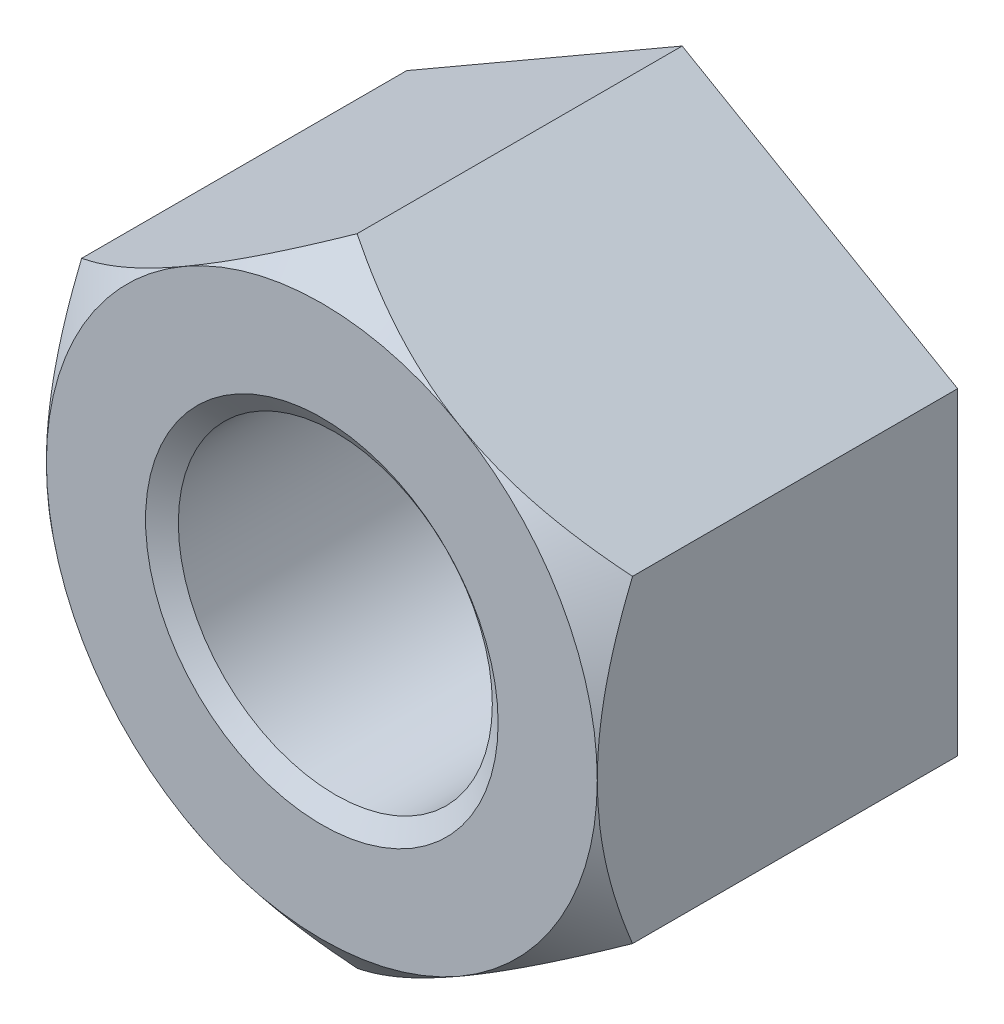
ISO-10303-21;
HEADER;
FILE_DESCRIPTION(('STEP AP214'),'2;1');
FILE_NAME('part.step','',(''),(''),'','','');
FILE_SCHEMA(('AUTOMOTIVE_DESIGN { 1 0 10303 214 1 1 1 1 }'));
ENDSEC;
DATA;
#1=APPLICATION_CONTEXT('core data for automotive mechanical design processes');
#2=APPLICATION_PROTOCOL_DEFINITION('international standard','automotive_design',2000,#1);
#3=PRODUCT_CONTEXT('',#1,'mechanical');
#4=PRODUCT('Part','Part','',(#3));
#5=PRODUCT_RELATED_PRODUCT_CATEGORY('part','',(#4));
#6=PRODUCT_DEFINITION_FORMATION('','',#4);
#7=PRODUCT_DEFINITION_CONTEXT('part definition',#1,'design');
#8=PRODUCT_DEFINITION('design','',#6,#7);
#9=PRODUCT_DEFINITION_SHAPE('','',#8);
#10=(LENGTH_UNIT() NAMED_UNIT(*) SI_UNIT(.MILLI.,.METRE.));
#11=(NAMED_UNIT(*) PLANE_ANGLE_UNIT() SI_UNIT($,.RADIAN.));
#12=(NAMED_UNIT(*) SI_UNIT($,.STERADIAN.) SOLID_ANGLE_UNIT());
#13=UNCERTAINTY_MEASURE_WITH_UNIT(LENGTH_MEASURE(1.E-05),#10,'distance_accuracy_value','');
#14=(GEOMETRIC_REPRESENTATION_CONTEXT(3) GLOBAL_UNCERTAINTY_ASSIGNED_CONTEXT((#13)) GLOBAL_UNIT_ASSIGNED_CONTEXT((#10,
#11,#12)) REPRESENTATION_CONTEXT('',''));
#15=CARTESIAN_POINT('',(0.,0.,0.));
#16=DIRECTION('',(0.,0.,1.));
#17=DIRECTION('',(1.,0.,0.));
#18=AXIS2_PLACEMENT_3D('',#15,#16,#17);
#19=CARTESIAN_POINT('',(0.,0.,-51.9176));
#20=DIRECTION('',(0.,0.,1.));
#21=DIRECTION('',(1.,0.,0.));
#22=AXIS2_PLACEMENT_3D('',#19,#20,#21);
#23=CYLINDRICAL_SURFACE('',#22,22.62124);
#24=CARTESIAN_POINT('',(0.,0.,-1.9457086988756));
#25=DIRECTION('',(0.,0.,1.));
#26=DIRECTION('',(1.,0.,0.));
#27=AXIS2_PLACEMENT_3D('',#24,#25,#26);
#28=CIRCLE('',#27,22.62124);
#29=CARTESIAN_POINT('',(22.62124,0.,-1.9457086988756));
#30=VERTEX_POINT('',#29);
#31=EDGE_CURVE('E137',#30,#30,#28,.F.);
#32=ORIENTED_EDGE('',*,*,#31,.F.);
#33=EDGE_LOOP('',(#32));
#34=FACE_BOUND('',#33,.T.);
#35=CARTESIAN_POINT('',(0.,0.,-49.9464913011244));
#36=DIRECTION('',(0.,0.,-1.));
#37=DIRECTION('',(-1.,0.,0.));
#38=AXIS2_PLACEMENT_3D('',#35,#36,#37);
#39=CIRCLE('',#38,22.62124);
#40=CARTESIAN_POINT('',(-22.62124,0.,-49.9464913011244));
#41=VERTEX_POINT('',#40);
#42=EDGE_CURVE('E44',#41,#41,#39,.F.);
#43=ORIENTED_EDGE('',*,*,#42,.F.);
#44=EDGE_LOOP('',(#43));
#45=FACE_BOUND('',#44,.T.);
#46=ADVANCED_FACE('F39',(#34,#45),#23,.F.);
#47=CARTESIAN_POINT('',(-79.3749999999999,0.,0.));
#48=DIRECTION('',(0.,0.,1.));
#49=DIRECTION('',(1.,0.,0.));
#50=AXIS2_PLACEMENT_3D('',#47,#48,#49);
#51=PLANE('',#50);
#52=CARTESIAN_POINT('',(0.,0.,0.));
#53=DIRECTION('',(0.,0.,1.));
#54=DIRECTION('',(1.,0.,0.));
#55=AXIS2_PLACEMENT_3D('',#52,#53,#54);
#56=CIRCLE('',#55,25.4);
#57=CARTESIAN_POINT('',(25.4,0.,0.));
#58=VERTEX_POINT('',#57);
#59=EDGE_CURVE('E232',#58,#58,#56,.T.);
#60=ORIENTED_EDGE('',*,*,#59,.F.);
#61=EDGE_LOOP('',(#60));
#62=FACE_BOUND('',#61,.T.);
#63=CARTESIAN_POINT('',(0.,0.,0.));
#64=DIRECTION('',(0.,0.,1.));
#65=DIRECTION('',(1.,0.,0.));
#66=AXIS2_PLACEMENT_3D('',#63,#64,#65);
#67=CIRCLE('',#66,39.6875);
#68=CARTESIAN_POINT('',(39.6875,0.,0.));
#69=VERTEX_POINT('',#68);
#70=CARTESIAN_POINT('',(19.84375,-34.3703832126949,0.));
#71=VERTEX_POINT('',#70);
#72=EDGE_CURVE('E11',#69,#71,#67,.F.);
#73=ORIENTED_EDGE('',*,*,#72,.F.);
#74=CARTESIAN_POINT('',(0.,0.,0.));
#75=DIRECTION('',(0.,0.,1.));
#76=DIRECTION('',(1.,0.,0.));
#77=AXIS2_PLACEMENT_3D('',#74,#75,#76);
#78=CIRCLE('',#77,39.6875);
#79=CARTESIAN_POINT('',(19.8437500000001,34.3703832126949,0.));
#80=VERTEX_POINT('',#79);
#81=EDGE_CURVE('E129',#69,#80,#78,.T.);
#82=ORIENTED_EDGE('',*,*,#81,.T.);
#83=CARTESIAN_POINT('',(-19.84375,34.3703832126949,0.));
#84=VERTEX_POINT('',#83);
#85=EDGE_CURVE('E51',#84,#80,#67,.F.);
#86=ORIENTED_EDGE('',*,*,#85,.F.);
#87=CARTESIAN_POINT('',(-39.6875,0.,0.));
#88=VERTEX_POINT('',#87);
#89=EDGE_CURVE('E286',#88,#84,#67,.F.);
#90=ORIENTED_EDGE('',*,*,#89,.F.);
#91=CARTESIAN_POINT('',(-19.84375,-34.3703832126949,0.));
#92=VERTEX_POINT('',#91);
#93=EDGE_CURVE('E288',#92,#88,#67,.F.);
#94=ORIENTED_EDGE('',*,*,#93,.F.);
#95=EDGE_CURVE('E49',#71,#92,#67,.F.);
#96=ORIENTED_EDGE('',*,*,#95,.F.);
#97=EDGE_LOOP('',(#73,#82,#86,#90,#94,#96));
#98=FACE_BOUND('',#97,.T.);
#99=ADVANCED_FACE('F139',(#62,#98),#51,.T.);
#100=CARTESIAN_POINT('',(0.,45.8271776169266,-51.9176));
#101=DIRECTION('',(-0.500000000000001,0.866025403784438,0.));
#102=DIRECTION('',(-0.866025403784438,-0.500000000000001,0.));
#103=AXIS2_PLACEMENT_3D('',#100,#101,#102);
#104=PLANE('',#103);
#105=CARTESIAN_POINT('',(0.000200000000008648,45.8272930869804,-5.08009554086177));
#106=CARTESIAN_POINT('',(-0.675362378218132,45.4372569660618,-4.75740980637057));
#107=CARTESIAN_POINT('',(-1.3547569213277,45.0450083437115,-4.44518483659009));
#108=CARTESIAN_POINT('',(-2.72161040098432,44.255855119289,-3.8444644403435));
#109=CARTESIAN_POINT('',(-3.40907190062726,43.8589490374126,-3.55597680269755));
#110=CARTESIAN_POINT('',(-4.79420473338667,43.0592422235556,-3.00488379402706));
#111=CARTESIAN_POINT('',(-5.49190147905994,42.6564268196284,-2.74236315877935));
#112=CARTESIAN_POINT('',(-6.89523688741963,41.8462107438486,-2.24748448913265));
#113=CARTESIAN_POINT('',(-7.60087484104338,41.4388104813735,-2.0151237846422));
#114=CARTESIAN_POINT('',(-9.01334120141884,40.6233226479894,-1.58581833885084));
#115=CARTESIAN_POINT('',(-9.72010005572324,40.2152752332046,-1.38856992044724));
#116=CARTESIAN_POINT('',(-11.1404844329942,39.3952159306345,-1.03010323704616));
#117=CARTESIAN_POINT('',(-11.8541100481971,38.9832039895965,-0.868885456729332));
#118=CARTESIAN_POINT('',(-13.2863448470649,38.1563028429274,-0.585602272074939));
#119=CARTESIAN_POINT('',(-14.0049472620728,37.7414175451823,-0.463491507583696));
#120=CARTESIAN_POINT('',(-15.446538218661,36.9091146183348,-0.260639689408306));
#121=CARTESIAN_POINT('',(-16.1695267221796,36.4916970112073,-0.179898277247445));
#122=CARTESIAN_POINT('',(-17.630331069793,35.6483012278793,-0.0605545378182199));
#123=CARTESIAN_POINT('',(-18.368192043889,35.2222969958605,-0.0226825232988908));
#124=CARTESIAN_POINT('',(-19.8446204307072,34.3698806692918,0.00757152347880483));
#125=CARTESIAN_POINT('',(-20.5831878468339,33.9434685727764,-4.66645945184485E-05));
#126=CARTESIAN_POINT('',(-22.059242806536,33.0912678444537,-0.0606042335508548));
#127=CARTESIAN_POINT('',(-22.7967297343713,32.6654795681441,-0.113563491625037));
#128=CARTESIAN_POINT('',(-24.2683079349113,31.8158634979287,-0.263592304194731));
#129=CARTESIAN_POINT('',(-25.0023992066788,31.3920357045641,-0.360661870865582));
#130=CARTESIAN_POINT('',(-26.465573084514,30.5472718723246,-0.596784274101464));
#131=CARTESIAN_POINT('',(-27.194654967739,30.1263362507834,-0.735843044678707));
#132=CARTESIAN_POINT('',(-28.6463836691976,29.288180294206,-1.05312836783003));
#133=CARTESIAN_POINT('',(-29.3690302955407,28.8709600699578,-1.23135608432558));
#134=CARTESIAN_POINT('',(-30.8067522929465,28.0408908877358,-1.62370548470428));
#135=CARTESIAN_POINT('',(-31.5218294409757,27.6280409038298,-1.83781853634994));
#136=CARTESIAN_POINT('',(-32.944072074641,26.8069087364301,-2.2985964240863));
#137=CARTESIAN_POINT('',(-33.6512373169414,26.3986266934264,-2.54526225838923));
#138=CARTESIAN_POINT('',(-34.8062681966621,25.7317693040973,-2.97446619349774));
#139=CARTESIAN_POINT('',(-35.2565422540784,25.471803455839,-3.14844506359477));
#140=CARTESIAN_POINT('',(-36.1535852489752,24.9538954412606,-3.50755980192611));
#141=CARTESIAN_POINT('',(-36.6003552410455,24.695952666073,-3.69269215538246));
#142=CARTESIAN_POINT('',(-37.4890449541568,24.1828674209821,-4.07269340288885));
#143=CARTESIAN_POINT('',(-37.9309759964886,23.9277184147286,-4.26752708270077));
#144=CARTESIAN_POINT('',(-38.811702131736,23.4192309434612,-4.66680287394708));
#145=CARTESIAN_POINT('',(-39.2504964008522,23.1658929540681,-4.87124740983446));
#146=CARTESIAN_POINT('',(-39.6877,22.9134733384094,-5.08009554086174));
#147=B_SPLINE_CURVE_WITH_KNOTS('',3,(#105,#106,#107,#108,#109,#110,#111,#112,#113,#114,#115,
#116,#117,#118,#119,#120,#121,#122,#123,#124,#125,#126,#127,#128,#129,#130,#131,#132,#133,#134,
#135,#136,#137,#138,#139,#140,#141,#142,#143,#144,#145,#146),.UNSPECIFIED.,.F.,.F.,(4,2,2,2,2,2,
2,2,2,2,2,2,2,2,2,2,2,2,2,2,4),(0.,2.53259620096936,5.06602012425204,7.60745580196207,
10.1486663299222,12.6667002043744,15.1847679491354,17.6999043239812,20.2150189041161,
22.7723642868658,25.329722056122,27.888201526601,30.4466817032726,33.0055236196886,
35.5644415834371,38.1227448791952,40.6811266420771,42.3258117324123,43.9699812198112,
45.608565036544,47.2475644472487),.UNSPECIFIED.);
#148=CARTESIAN_POINT('',(0.,45.8271776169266,-5.08));
#149=VERTEX_POINT('',#148);
#150=EDGE_CURVE('E193',#149,#84,#147,.T.);
#151=ORIENTED_EDGE('',*,*,#150,.F.);
#152=DIRECTION('',(0.,0.,1.));
#153=VECTOR('',#152,1.);
#154=CARTESIAN_POINT('',(0.,45.8271776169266,-51.9176));
#155=LINE('',#154,#153);
#156=CARTESIAN_POINT('',(0.,45.8271776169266,-51.9176));
#157=VERTEX_POINT('',#156);
#158=EDGE_CURVE('E256',#157,#149,#155,.T.);
#159=ORIENTED_EDGE('',*,*,#158,.F.);
#160=DIRECTION('',(-0.866025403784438,-0.500000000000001,0.));
#161=VECTOR('',#160,1.);
#162=CARTESIAN_POINT('',(0.,45.8271776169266,-51.9176));
#163=LINE('',#162,#161);
#164=CARTESIAN_POINT('',(-39.6875,22.9135888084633,-51.9176));
#165=VERTEX_POINT('',#164);
#166=EDGE_CURVE('E145',#157,#165,#163,.T.);
#167=ORIENTED_EDGE('',*,*,#166,.T.);
#168=DIRECTION('',(0.,0.,1.));
#169=VECTOR('',#168,1.);
#170=CARTESIAN_POINT('',(-39.6875,22.9135888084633,-51.9176));
#171=LINE('',#170,#169);
#172=CARTESIAN_POINT('',(-39.6875,22.9135888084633,-5.08));
#173=VERTEX_POINT('',#172);
#174=EDGE_CURVE('E243',#165,#173,#171,.T.);
#175=ORIENTED_EDGE('',*,*,#174,.T.);
#176=EDGE_CURVE('E187',#84,#173,#147,.T.);
#177=ORIENTED_EDGE('',*,*,#176,.F.);
#178=EDGE_LOOP('',(#151,#159,#167,#175,#177));
#179=FACE_BOUND('',#178,.T.);
#180=ADVANCED_FACE('F41',(#179),#104,.T.);
#181=CARTESIAN_POINT('',(39.6875,22.9135888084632,-51.9176));
#182=DIRECTION('',(0.500000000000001,0.866025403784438,0.));
#183=DIRECTION('',(-0.866025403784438,0.500000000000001,0.));
#184=AXIS2_PLACEMENT_3D('',#181,#182,#183);
#185=PLANE('',#184);
#186=CARTESIAN_POINT('',(39.6877,22.9134733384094,-5.08009554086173));
#187=CARTESIAN_POINT('',(39.0121376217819,23.303509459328,-4.75740980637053));
#188=CARTESIAN_POINT('',(38.3327430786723,23.6957580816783,-4.44518483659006));
#189=CARTESIAN_POINT('',(36.9658895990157,24.4849113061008,-3.84446444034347));
#190=CARTESIAN_POINT('',(36.2784280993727,24.8818173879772,-3.55597680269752));
#191=CARTESIAN_POINT('',(34.8932952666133,25.6815242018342,-3.00488379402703));
#192=CARTESIAN_POINT('',(34.1955985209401,26.0843396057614,-2.74236315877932));
#193=CARTESIAN_POINT('',(32.7922631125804,26.8945556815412,-2.24748448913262));
#194=CARTESIAN_POINT('',(32.0866251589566,27.3019559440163,-2.01512378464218));
#195=CARTESIAN_POINT('',(30.6741587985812,28.1174437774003,-1.58581833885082));
#196=CARTESIAN_POINT('',(29.9673999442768,28.5254911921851,-1.38856992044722));
#197=CARTESIAN_POINT('',(28.5470155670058,29.3455504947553,-1.03010323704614));
#198=CARTESIAN_POINT('',(27.8333899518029,29.7575624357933,-0.868885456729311));
#199=CARTESIAN_POINT('',(26.4011551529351,30.5844635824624,-0.585602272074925));
#200=CARTESIAN_POINT('',(25.6825527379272,30.9993488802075,-0.463491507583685));
#201=CARTESIAN_POINT('',(24.240961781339,31.831651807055,-0.260639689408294));
#202=CARTESIAN_POINT('',(23.5179732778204,32.2490694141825,-0.179898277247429));
#203=CARTESIAN_POINT('',(22.057168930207,33.0924651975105,-0.060554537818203));
#204=CARTESIAN_POINT('',(21.3193079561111,33.5184694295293,-0.0226825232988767));
#205=CARTESIAN_POINT('',(19.8428795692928,34.370885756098,0.0075715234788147));
#206=CARTESIAN_POINT('',(19.1043121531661,34.7972978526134,-4.66645945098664E-05));
#207=CARTESIAN_POINT('',(17.628257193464,35.6494985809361,-0.0606042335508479));
#208=CARTESIAN_POINT('',(16.8907702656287,36.0752868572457,-0.11356349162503));
#209=CARTESIAN_POINT('',(15.4191920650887,36.924902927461,-0.263592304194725));
#210=CARTESIAN_POINT('',(14.6851007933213,37.3487307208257,-0.360661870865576));
#211=CARTESIAN_POINT('',(13.221926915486,38.1934945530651,-0.596784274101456));
#212=CARTESIAN_POINT('',(12.492845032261,38.6144301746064,-0.7358430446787));
#213=CARTESIAN_POINT('',(11.0411163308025,39.4525861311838,-1.05312836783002));
#214=CARTESIAN_POINT('',(10.3184697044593,39.869806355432,-1.23135608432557));
#215=CARTESIAN_POINT('',(8.88074770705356,40.699875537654,-1.62370548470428));
#216=CARTESIAN_POINT('',(8.16567055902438,41.11272552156,-1.83781853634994));
#217=CARTESIAN_POINT('',(6.74342792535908,41.9338576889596,-2.29859642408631));
#218=CARTESIAN_POINT('',(6.0362626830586,42.3421397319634,-2.54526225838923));
#219=CARTESIAN_POINT('',(4.8812318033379,43.0089971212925,-2.97446619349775));
#220=CARTESIAN_POINT('',(4.43095774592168,43.2689629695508,-3.14844506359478));
#221=CARTESIAN_POINT('',(3.53391475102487,43.7868709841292,-3.50755980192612));
#222=CARTESIAN_POINT('',(3.08714475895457,44.0448137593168,-3.69269215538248));
#223=CARTESIAN_POINT('',(2.19845504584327,44.5578990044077,-4.07269340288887));
#224=CARTESIAN_POINT('',(1.75652400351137,44.8130480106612,-4.26752708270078));
#225=CARTESIAN_POINT('',(0.875797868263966,45.3215354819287,-4.6668028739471));
#226=CARTESIAN_POINT('',(0.437003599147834,45.5748734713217,-4.87124740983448));
#227=CARTESIAN_POINT('',(-0.000199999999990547,45.8272930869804,-5.08009554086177));
#228=B_SPLINE_CURVE_WITH_KNOTS('',3,(#186,#187,#188,#189,#190,#191,#192,#193,#194,#195,#196,
#197,#198,#199,#200,#201,#202,#203,#204,#205,#206,#207,#208,#209,#210,#211,#212,#213,#214,#215,
#216,#217,#218,#219,#220,#221,#222,#223,#224,#225,#226,#227),.UNSPECIFIED.,.F.,.F.,(4,2,2,2,2,2,
2,2,2,2,2,2,2,2,2,2,2,2,2,2,4),(0.,2.53259620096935,5.06602012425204,7.60745580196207,
10.1486663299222,12.6667002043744,15.1847679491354,17.6999043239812,20.2150189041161,
22.7723642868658,25.329722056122,27.888201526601,30.4466817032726,33.0055236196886,
35.564441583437,38.1227448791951,40.681126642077,42.3258117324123,43.9699812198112,
45.608565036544,47.2475644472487),.UNSPECIFIED.);
#229=CARTESIAN_POINT('',(39.6875,22.9135888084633,-5.08));
#230=VERTEX_POINT('',#229);
#231=EDGE_CURVE('E132',#230,#80,#228,.T.);
#232=ORIENTED_EDGE('',*,*,#231,.F.);
#233=DIRECTION('',(0.,0.,1.));
#234=VECTOR('',#233,1.);
#235=CARTESIAN_POINT('',(39.6875,22.9135888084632,-51.9176));
#236=LINE('',#235,#234);
#237=CARTESIAN_POINT('',(39.6875,22.9135888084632,-51.9176));
#238=VERTEX_POINT('',#237);
#239=EDGE_CURVE('E144',#238,#230,#236,.T.);
#240=ORIENTED_EDGE('',*,*,#239,.F.);
#241=DIRECTION('',(-0.866025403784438,0.500000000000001,0.));
#242=VECTOR('',#241,1.);
#243=CARTESIAN_POINT('',(39.6875,22.9135888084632,-51.9176));
#244=LINE('',#243,#242);
#245=EDGE_CURVE('E247',#238,#157,#244,.T.);
#246=ORIENTED_EDGE('',*,*,#245,.T.);
#247=ORIENTED_EDGE('',*,*,#158,.T.);
#248=EDGE_CURVE('E156',#80,#149,#228,.T.);
#249=ORIENTED_EDGE('',*,*,#248,.F.);
#250=EDGE_LOOP('',(#232,#240,#246,#247,#249));
#251=FACE_BOUND('',#250,.T.);
#252=ADVANCED_FACE('F172',(#251),#185,.T.);
#253=CARTESIAN_POINT('',(39.6875,22.9135888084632,-51.9176));
#254=DIRECTION('',(-1.,0.,0.));
#255=DIRECTION('',(0.,-1.,0.));
#256=AXIS2_PLACEMENT_3D('',#253,#254,#255);
#257=PLANE('',#256);
#258=ORIENTED_EDGE('',*,*,#239,.T.);
#259=CARTESIAN_POINT('',(39.6875,-51.6328225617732,-21.0457198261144));
#260=CARTESIAN_POINT('',(39.6875,-50.9711763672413,-20.6116874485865));
#261=CARTESIAN_POINT('',(39.6875,-50.3081162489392,-20.1798041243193));
#262=CARTESIAN_POINT('',(39.6875,-48.9789178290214,-19.3207795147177));
#263=CARTESIAN_POINT('',(39.6875,-48.3127794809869,-18.8936383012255));
#264=CARTESIAN_POINT('',(39.6875,-46.9770520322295,-18.0444645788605));
#265=CARTESIAN_POINT('',(39.6875,-46.3074622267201,-17.6224331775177));
#266=CARTESIAN_POINT('',(39.6875,-44.9647085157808,-16.7841033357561));
#267=CARTESIAN_POINT('',(39.6875,-44.2915446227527,-16.3678048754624));
#268=CARTESIAN_POINT('',(39.6875,-42.2568910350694,-15.1226295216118));
#269=CARTESIAN_POINT('',(39.6875,-40.8894876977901,-14.303373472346));
#270=CARTESIAN_POINT('',(39.6875,-38.1364157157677,-12.6961963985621));
#271=CARTESIAN_POINT('',(39.6875,-36.7507482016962,-11.9082734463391));
#272=CARTESIAN_POINT('',(39.6875,-34.6202465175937,-10.7357414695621));
#273=CARTESIAN_POINT('',(39.6875,-33.883142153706,-10.3370700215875));
#274=CARTESIAN_POINT('',(39.6875,-32.4025093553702,-9.5518101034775));
#275=CARTESIAN_POINT('',(39.6875,-31.6589809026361,-9.1652216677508));
#276=CARTESIAN_POINT('',(39.6875,-30.1648802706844,-8.40558030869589));
#277=CARTESIAN_POINT('',(39.6875,-29.4143069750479,-8.03252957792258));
#278=CARTESIAN_POINT('',(39.6875,-27.9057210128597,-7.30176643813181));
#279=CARTESIAN_POINT('',(39.6875,-27.1477083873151,-6.94405394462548));
#280=CARTESIAN_POINT('',(39.6875,-25.6257322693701,-6.24685408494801));
#281=CARTESIAN_POINT('',(39.6875,-24.8617895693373,-5.9073214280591));
#282=CARTESIAN_POINT('',(39.6875,-23.3255198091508,-5.24768587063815));
#283=CARTESIAN_POINT('',(39.6875,-22.5531925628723,-4.92758340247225));
#284=CARTESIAN_POINT('',(39.6875,-21.0000557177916,-4.30940863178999));
#285=CARTESIAN_POINT('',(39.6875,-20.2192491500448,-4.01132873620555));
#286=CARTESIAN_POINT('',(39.6875,-18.6486688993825,-3.43983380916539));
#287=CARTESIAN_POINT('',(39.6875,-17.8588956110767,-3.16641769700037));
#288=CARTESIAN_POINT('',(39.6875,-16.2782209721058,-2.64980510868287));
#289=CARTESIAN_POINT('',(39.6875,-15.4874096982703,-2.40633404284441));
#290=CARTESIAN_POINT('',(39.6875,-13.8971196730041,-1.949521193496));
#291=CARTESIAN_POINT('',(39.6875,-13.0976411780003,-1.73617852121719));
#292=CARTESIAN_POINT('',(39.6875,-11.490505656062,-1.34270689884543));
#293=CARTESIAN_POINT('',(39.6875,-10.6828485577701,-1.16257823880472));
#294=CARTESIAN_POINT('',(39.6875,-9.06026613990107,-0.838523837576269));
#295=CARTESIAN_POINT('',(39.6875,-8.24534084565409,-0.694597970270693));
#296=CARTESIAN_POINT('',(39.6875,-6.62443803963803,-0.44789053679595));
#297=CARTESIAN_POINT('',(39.6875,-5.81856783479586,-0.344407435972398));
#298=CARTESIAN_POINT('',(39.6875,-4.20271348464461,-0.176943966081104));
#299=CARTESIAN_POINT('',(39.6875,-3.39272937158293,-0.112963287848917));
#300=CARTESIAN_POINT('',(39.6875,-1.77060014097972,-0.0258418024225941));
#301=CARTESIAN_POINT('',(39.6875,-0.958455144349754,-0.00269875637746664));
#302=CARTESIAN_POINT('',(39.6875,0.665955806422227,0.00225284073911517));
#303=CARTESIAN_POINT('',(39.6875,1.47822175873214,-0.0159380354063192));
#304=CARTESIAN_POINT('',(39.6875,3.04262978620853,-0.0904816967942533));
#305=CARTESIAN_POINT('',(39.6875,3.79490888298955,-0.144006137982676));
#306=CARTESIAN_POINT('',(39.6875,5.29621422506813,-0.285354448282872));
#307=CARTESIAN_POINT('',(39.6875,6.04524051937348,-0.373177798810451));
#308=CARTESIAN_POINT('',(39.6875,7.53870946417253,-0.581619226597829));
#309=CARTESIAN_POINT('',(39.6875,8.28315200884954,-0.70223805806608));
#310=CARTESIAN_POINT('',(39.6875,9.76635407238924,-0.974351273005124));
#311=CARTESIAN_POINT('',(39.6875,10.5051135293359,-1.125845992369));
#312=CARTESIAN_POINT('',(39.6875,11.9915712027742,-1.4610042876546));
#313=CARTESIAN_POINT('',(39.6875,12.739131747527,-1.64527612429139));
#314=CARTESIAN_POINT('',(39.6875,14.22692970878,-2.04125829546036));
#315=CARTESIAN_POINT('',(39.6875,14.9671670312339,-2.25296898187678));
#316=CARTESIAN_POINT('',(39.6875,16.4398374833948,-2.70128400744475));
#317=CARTESIAN_POINT('',(39.6875,17.1722725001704,-2.93788216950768));
#318=CARTESIAN_POINT('',(39.6875,18.6294175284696,-3.43359252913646));
#319=CARTESIAN_POINT('',(39.6875,19.3541279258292,-3.6927035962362));
#320=CARTESIAN_POINT('',(39.6875,20.8232310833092,-4.24136165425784));
#321=CARTESIAN_POINT('',(39.6875,21.5673316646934,-4.53168910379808));
#322=CARTESIAN_POINT('',(39.6875,23.0476598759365,-5.13183376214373));
#323=CARTESIAN_POINT('',(39.6875,23.7838870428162,-5.44165210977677));
#324=CARTESIAN_POINT('',(39.6875,25.2489982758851,-6.07874085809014));
#325=CARTESIAN_POINT('',(39.6875,25.9778800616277,-6.4060164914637));
#326=CARTESIAN_POINT('',(39.6875,27.4284730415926,-7.07603037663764));
#327=CARTESIAN_POINT('',(39.6875,28.150184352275,-7.41876837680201));
#328=CARTESIAN_POINT('',(39.6875,29.5878108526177,-8.11847594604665));
#329=CARTESIAN_POINT('',(39.6875,30.3037174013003,-8.47546323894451));
#330=CARTESIAN_POINT('',(39.6875,31.7292596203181,-9.20177066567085));
#331=CARTESIAN_POINT('',(39.6875,32.4388951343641,-9.57109110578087));
#332=CARTESIAN_POINT('',(39.6875,33.8522184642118,-10.3206859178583));
#333=CARTESIAN_POINT('',(39.6875,34.5559071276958,-10.7009586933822));
#334=CARTESIAN_POINT('',(39.6875,35.9578716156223,-11.4713640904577));
#335=CARTESIAN_POINT('',(39.6875,36.6561473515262,-11.8614968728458));
#336=CARTESIAN_POINT('',(39.6875,38.7525009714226,-13.0502493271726));
#337=CARTESIAN_POINT('',(39.6875,40.1429535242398,-13.8623368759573));
#338=CARTESIAN_POINT('',(39.6875,42.9065478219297,-15.5153833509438));
#339=CARTESIAN_POINT('',(39.6875,44.2796891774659,-16.3563429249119));
#340=CARTESIAN_POINT('',(39.6875,47.0102618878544,-18.0612949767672));
#341=CARTESIAN_POINT('',(39.6875,48.3677033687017,-18.9252712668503));
#342=CARTESIAN_POINT('',(39.6875,51.0699566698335,-20.6726859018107));
#343=CARTESIAN_POINT('',(39.6875,52.4147686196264,-21.5561240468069));
#344=CARTESIAN_POINT('',(39.6875,54.9416289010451,-23.2381057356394));
#345=CARTESIAN_POINT('',(39.6875,56.124835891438,-24.0349116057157));
#346=CARTESIAN_POINT('',(39.6875,58.4837915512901,-25.6394756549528));
#347=CARTESIAN_POINT('',(39.6875,59.6595402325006,-26.447233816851));
#348=CARTESIAN_POINT('',(39.6875,62.004680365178,-28.0723416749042));
#349=CARTESIAN_POINT('',(39.6875,63.1740707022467,-28.8896929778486));
#350=CARTESIAN_POINT('',(39.6875,65.5070659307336,-30.5326124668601));
#351=CARTESIAN_POINT('',(39.6875,66.6706708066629,-31.358180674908));
#352=CARTESIAN_POINT('',(39.6875,68.9768909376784,-33.0051660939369));
#353=CARTESIAN_POINT('',(39.6875,70.1195757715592,-33.8264859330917));
#354=CARTESIAN_POINT('',(39.6875,72.4005033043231,-35.475271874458));
#355=CARTESIAN_POINT('',(39.6875,73.5387459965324,-36.3027379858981));
#356=CARTESIAN_POINT('',(39.6875,75.8109571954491,-37.9628759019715));
#357=CARTESIAN_POINT('',(39.6875,76.9449267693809,-38.795546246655));
#358=CARTESIAN_POINT('',(39.6875,79.2092896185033,-40.4657187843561));
#359=CARTESIAN_POINT('',(39.6875,80.3396829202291,-41.3032209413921));
#360=CARTESIAN_POINT('',(39.6875,81.468491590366,-42.1428481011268));
#361=B_SPLINE_CURVE_WITH_KNOTS('',3,(#259,#260,#261,#262,#263,#264,#265,#266,#267,#268,#269,
#270,#271,#272,#273,#274,#275,#276,#277,#278,#279,#280,#281,#282,#283,#284,#285,#286,#287,#288,
#289,#290,#291,#292,#293,#294,#295,#296,#297,#298,#299,#300,#301,#302,#303,#304,#305,#306,#307,
#308,#309,#310,#311,#312,#313,#314,#315,#316,#317,#318,#319,#320,#321,#322,#323,#324,#325,#326,
#327,#328,#329,#330,#331,#332,#333,#334,#335,#336,#337,#338,#339,#340,#341,#342,#343,#344,#345,
#346,#347,#348,#349,#350,#351,#352,#353,#354,#355,#356,#357,#358,#359,#360),.UNSPECIFIED.,.F.,
.F.,(4,2,2,2,2,2,2,2,2,2,2,2,2,2,2,2,2,2,2,2,2,2,2,2,2,2,2,2,2,2,2,2,2,2,2,2,2,2,2,2,2,2,2,2,2,
2,2,2,2,2,4),(0.,2.37390854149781,4.74785299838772,7.12230310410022,9.49674497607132,
14.2785351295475,19.060030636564,21.5739708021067,24.0879181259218,26.6022708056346,
29.1166096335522,31.6243614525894,34.1321690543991,36.6391079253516,39.1459368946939,
41.6277244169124,44.1094387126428,46.59117467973,49.0729020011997,51.5094354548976,
53.9459498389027,56.3823306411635,58.8186776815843,61.0804212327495,63.3421305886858,
65.6038919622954,67.8656779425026,70.1749197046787,72.4841910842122,74.7928906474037,
77.101474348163,79.4973670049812,81.8933997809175,84.2901548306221,86.6868708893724,
89.0866671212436,91.4865229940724,93.8860308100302,96.2855777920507,101.11578528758,
105.946101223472,110.773105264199,115.600059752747,119.87946643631,124.158866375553,
128.438993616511,132.719132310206,136.940798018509,141.162470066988,145.383006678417,
149.603511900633),.UNSPECIFIED.);
#362=EDGE_CURVE('E124',#230,#69,#361,.F.);
#363=ORIENTED_EDGE('',*,*,#362,.T.);
#364=CARTESIAN_POINT('',(39.6875,-22.9135888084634,-5.08));
#365=VERTEX_POINT('',#364);
#366=EDGE_CURVE('E113',#69,#365,#361,.F.);
#367=ORIENTED_EDGE('',*,*,#366,.T.);
#368=DIRECTION('',(0.,0.,1.));
#369=VECTOR('',#368,1.);
#370=CARTESIAN_POINT('',(39.6875,-22.9135888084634,-51.9176));
#371=LINE('',#370,#369);
#372=CARTESIAN_POINT('',(39.6875,-22.9135888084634,-51.9176));
#373=VERTEX_POINT('',#372);
#374=EDGE_CURVE('E253',#373,#365,#371,.T.);
#375=ORIENTED_EDGE('',*,*,#374,.F.);
#376=DIRECTION('',(0.,-1.,0.));
#377=VECTOR('',#376,1.);
#378=CARTESIAN_POINT('',(39.6875,22.9135888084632,-51.9176));
#379=LINE('',#378,#377);
#380=EDGE_CURVE('E261',#238,#373,#379,.T.);
#381=ORIENTED_EDGE('',*,*,#380,.F.);
#382=EDGE_LOOP('',(#258,#363,#367,#375,#381));
#383=FACE_BOUND('',#382,.T.);
#384=ADVANCED_FACE('F142',(#383),#257,.F.);
#385=CARTESIAN_POINT('',(0.,-45.8271776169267,-51.9176));
#386=DIRECTION('',(0.500000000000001,-0.866025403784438,0.));
#387=DIRECTION('',(0.866025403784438,0.500000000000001,0.));
#388=AXIS2_PLACEMENT_3D('',#385,#386,#387);
#389=PLANE('',#388);
#390=CARTESIAN_POINT('',(-0.000200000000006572,-45.8272930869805,-5.08009554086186));
#391=CARTESIAN_POINT('',(0.675362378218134,-45.4372569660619,-4.75740980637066));
#392=CARTESIAN_POINT('',(1.3547569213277,-45.0450083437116,-4.44518483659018));
#393=CARTESIAN_POINT('',(2.72161040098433,-44.2558551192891,-3.84446444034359));
#394=CARTESIAN_POINT('',(3.40907190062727,-43.8589490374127,-3.55597680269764));
#395=CARTESIAN_POINT('',(4.79420473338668,-43.0592422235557,-3.00488379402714));
#396=CARTESIAN_POINT('',(5.49190147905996,-42.6564268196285,-2.74236315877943));
#397=CARTESIAN_POINT('',(6.89523688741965,-41.8462107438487,-2.24748448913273));
#398=CARTESIAN_POINT('',(7.6008748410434,-41.4388104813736,-2.01512378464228));
#399=CARTESIAN_POINT('',(9.01334120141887,-40.6233226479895,-1.58581833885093));
#400=CARTESIAN_POINT('',(9.72010005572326,-40.2152752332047,-1.38856992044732));
#401=CARTESIAN_POINT('',(11.1404844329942,-39.3952159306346,-1.03010323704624));
#402=CARTESIAN_POINT('',(11.8541100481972,-38.9832039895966,-0.868885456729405));
#403=CARTESIAN_POINT('',(13.2863448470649,-38.1563028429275,-0.585602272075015));
#404=CARTESIAN_POINT('',(14.0049472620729,-37.7414175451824,-0.463491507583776));
#405=CARTESIAN_POINT('',(15.446538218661,-36.9091146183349,-0.260639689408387));
#406=CARTESIAN_POINT('',(16.1695267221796,-36.4916970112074,-0.179898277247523));
#407=CARTESIAN_POINT('',(17.6303310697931,-35.6483012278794,-0.060554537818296));
#408=CARTESIAN_POINT('',(18.368192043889,-35.2222969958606,-0.022682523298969));
#409=CARTESIAN_POINT('',(19.8446204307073,-34.3698806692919,0.00757152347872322));
#410=CARTESIAN_POINT('',(20.583187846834,-33.9434685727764,-4.66645946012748E-05));
#411=CARTESIAN_POINT('',(22.059242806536,-33.0912678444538,-0.0606042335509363));
#412=CARTESIAN_POINT('',(22.7967297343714,-32.6654795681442,-0.113563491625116));
#413=CARTESIAN_POINT('',(24.2683079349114,-31.8158634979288,-0.263592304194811));
#414=CARTESIAN_POINT('',(25.0023992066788,-31.3920357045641,-0.360661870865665));
#415=CARTESIAN_POINT('',(26.4655730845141,-30.5472718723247,-0.596784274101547));
#416=CARTESIAN_POINT('',(27.1946549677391,-30.1263362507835,-0.735843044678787));
#417=CARTESIAN_POINT('',(28.6463836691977,-29.2881802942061,-1.05312836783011));
#418=CARTESIAN_POINT('',(29.3690302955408,-28.8709600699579,-1.23135608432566));
#419=CARTESIAN_POINT('',(30.8067522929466,-28.0408908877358,-1.62370548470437));
#420=CARTESIAN_POINT('',(31.5218294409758,-27.6280409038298,-1.83781853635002));
#421=CARTESIAN_POINT('',(32.9440720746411,-26.8069087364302,-2.29859642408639));
#422=CARTESIAN_POINT('',(33.6512373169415,-26.3986266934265,-2.54526225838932));
#423=CARTESIAN_POINT('',(34.8062681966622,-25.7317693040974,-2.97446619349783));
#424=CARTESIAN_POINT('',(35.2565422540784,-25.471803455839,-3.14844506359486));
#425=CARTESIAN_POINT('',(36.1535852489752,-24.9538954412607,-3.50755980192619));
#426=CARTESIAN_POINT('',(36.6003552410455,-24.6959526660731,-3.69269215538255));
#427=CARTESIAN_POINT('',(37.4890449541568,-24.1828674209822,-4.07269340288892));
#428=CARTESIAN_POINT('',(37.9309759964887,-23.9277184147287,-4.26752708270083));
#429=CARTESIAN_POINT('',(38.8117021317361,-23.4192309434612,-4.66680287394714));
#430=CARTESIAN_POINT('',(39.2504964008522,-23.1658929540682,-4.87124740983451));
#431=CARTESIAN_POINT('',(39.6877,-22.9134733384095,-5.08009554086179));
#432=B_SPLINE_CURVE_WITH_KNOTS('',3,(#390,#391,#392,#393,#394,#395,#396,#397,#398,#399,#400,
#401,#402,#403,#404,#405,#406,#407,#408,#409,#410,#411,#412,#413,#414,#415,#416,#417,#418,#419,
#420,#421,#422,#423,#424,#425,#426,#427,#428,#429,#430,#431),.UNSPECIFIED.,.F.,.F.,(4,2,2,2,2,2,
2,2,2,2,2,2,2,2,2,2,2,2,2,2,4),(0.,2.53259620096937,5.06602012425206,7.60745580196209,
10.1486663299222,12.6667002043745,15.1847679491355,17.6999043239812,20.2150189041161,
22.7723642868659,25.3297220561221,27.8882015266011,30.4466817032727,33.0055236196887,
35.5644415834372,38.1227448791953,40.6811266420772,42.3258117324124,43.9699812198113,
45.6085650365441,47.2475644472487),.UNSPECIFIED.);
#433=CARTESIAN_POINT('',(-1.97758476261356E-13,-45.8271776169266,-5.08));
#434=VERTEX_POINT('',#433);
#435=EDGE_CURVE('E58',#434,#71,#432,.T.);
#436=ORIENTED_EDGE('',*,*,#435,.F.);
#437=DIRECTION('',(0.,0.,1.));
#438=VECTOR('',#437,1.);
#439=CARTESIAN_POINT('',(0.,-45.8271776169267,-51.9176));
#440=LINE('',#439,#438);
#441=CARTESIAN_POINT('',(0.,-45.8271776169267,-51.9176));
#442=VERTEX_POINT('',#441);
#443=EDGE_CURVE('E250',#442,#434,#440,.T.);
#444=ORIENTED_EDGE('',*,*,#443,.F.);
#445=DIRECTION('',(0.866025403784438,0.500000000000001,0.));
#446=VECTOR('',#445,1.);
#447=CARTESIAN_POINT('',(0.,-45.8271776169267,-51.9176));
#448=LINE('',#447,#446);
#449=EDGE_CURVE('E263',#442,#373,#448,.T.);
#450=ORIENTED_EDGE('',*,*,#449,.T.);
#451=ORIENTED_EDGE('',*,*,#374,.T.);
#452=EDGE_CURVE('E119',#71,#365,#432,.T.);
#453=ORIENTED_EDGE('',*,*,#452,.F.);
#454=EDGE_LOOP('',(#436,#444,#450,#451,#453));
#455=FACE_BOUND('',#454,.T.);
#456=ADVANCED_FACE('F171',(#455),#389,.T.);
#457=CARTESIAN_POINT('',(-39.6875,-22.9135888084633,-51.9176));
#458=DIRECTION('',(-0.500000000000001,-0.866025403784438,0.));
#459=DIRECTION('',(0.866025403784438,-0.500000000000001,0.));
#460=AXIS2_PLACEMENT_3D('',#457,#458,#459);
#461=PLANE('',#460);
#462=CARTESIAN_POINT('',(-39.6877,-22.9134733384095,-5.08009554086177));
#463=CARTESIAN_POINT('',(-39.0121376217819,-23.3035094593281,-4.75740980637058));
#464=CARTESIAN_POINT('',(-38.3327430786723,-23.6957580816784,-4.4451848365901));
#465=CARTESIAN_POINT('',(-36.9658895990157,-24.4849113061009,-3.84446444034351));
#466=CARTESIAN_POINT('',(-36.2784280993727,-24.8818173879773,-3.55597680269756));
#467=CARTESIAN_POINT('',(-34.8932952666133,-25.6815242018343,-3.00488379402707));
#468=CARTESIAN_POINT('',(-34.19559852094,-26.0843396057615,-2.74236315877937));
#469=CARTESIAN_POINT('',(-32.7922631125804,-26.8945556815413,-2.24748448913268));
#470=CARTESIAN_POINT('',(-32.0866251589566,-27.3019559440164,-2.01512378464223));
#471=CARTESIAN_POINT('',(-30.6741587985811,-28.1174437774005,-1.58581833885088));
#472=CARTESIAN_POINT('',(-29.9673999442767,-28.5254911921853,-1.38856992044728));
#473=CARTESIAN_POINT('',(-28.5470155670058,-29.3455504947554,-1.0301032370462));
#474=CARTESIAN_POINT('',(-27.8333899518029,-29.7575624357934,-0.86888545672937));
#475=CARTESIAN_POINT('',(-26.4011551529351,-30.5844635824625,-0.585602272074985));
#476=CARTESIAN_POINT('',(-25.6825527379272,-30.9993488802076,-0.463491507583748));
#477=CARTESIAN_POINT('',(-24.240961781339,-31.8316518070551,-0.26063968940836));
#478=CARTESIAN_POINT('',(-23.5179732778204,-32.2490694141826,-0.179898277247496));
#479=CARTESIAN_POINT('',(-22.057168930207,-33.0924651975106,-0.0605545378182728));
#480=CARTESIAN_POINT('',(-21.319307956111,-33.5184694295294,-0.0226825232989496));
#481=CARTESIAN_POINT('',(-19.8428795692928,-34.3708857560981,0.00757152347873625));
#482=CARTESIAN_POINT('',(-19.1043121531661,-34.7972978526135,-4.6664594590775E-05));
#483=CARTESIAN_POINT('',(-17.628257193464,-35.6494985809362,-0.0606042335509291));
#484=CARTESIAN_POINT('',(-16.8907702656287,-36.0752868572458,-0.113563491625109));
#485=CARTESIAN_POINT('',(-15.4191920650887,-36.9249029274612,-0.263592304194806));
#486=CARTESIAN_POINT('',(-14.6851007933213,-37.3487307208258,-0.360661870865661));
#487=CARTESIAN_POINT('',(-13.221926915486,-38.1934945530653,-0.596784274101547));
#488=CARTESIAN_POINT('',(-12.492845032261,-38.6144301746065,-0.735843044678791));
#489=CARTESIAN_POINT('',(-11.0411163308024,-39.4525861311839,-1.05312836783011));
#490=CARTESIAN_POINT('',(-10.3184697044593,-39.8698063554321,-1.23135608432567));
#491=CARTESIAN_POINT('',(-8.88074770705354,-40.6998755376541,-1.62370548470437));
#492=CARTESIAN_POINT('',(-8.16567055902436,-41.1127255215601,-1.83781853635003));
#493=CARTESIAN_POINT('',(-6.74342792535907,-41.9338576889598,-2.2985964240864));
#494=CARTESIAN_POINT('',(-6.03626268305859,-42.3421397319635,-2.54526225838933));
#495=CARTESIAN_POINT('',(-4.88123180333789,-43.0089971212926,-2.97446619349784));
#496=CARTESIAN_POINT('',(-4.43095774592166,-43.2689629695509,-3.14844506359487));
#497=CARTESIAN_POINT('',(-3.53391475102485,-43.7868709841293,-3.50755980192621));
#498=CARTESIAN_POINT('',(-3.08714475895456,-44.0448137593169,-3.69269215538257));
#499=CARTESIAN_POINT('',(-2.19845504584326,-44.5578990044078,-4.07269340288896));
#500=CARTESIAN_POINT('',(-1.75652400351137,-44.8130480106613,-4.26752708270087));
#501=CARTESIAN_POINT('',(-0.875797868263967,-45.3215354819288,-4.66680287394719));
#502=CARTESIAN_POINT('',(-0.437003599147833,-45.5748734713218,-4.87124740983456));
#503=CARTESIAN_POINT('',(0.000199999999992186,-45.8272930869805,-5.08009554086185));
#504=B_SPLINE_CURVE_WITH_KNOTS('',3,(#462,#463,#464,#465,#466,#467,#468,#469,#470,#471,#472,
#473,#474,#475,#476,#477,#478,#479,#480,#481,#482,#483,#484,#485,#486,#487,#488,#489,#490,#491,
#492,#493,#494,#495,#496,#497,#498,#499,#500,#501,#502,#503),.UNSPECIFIED.,.F.,.F.,(4,2,2,2,2,2,
2,2,2,2,2,2,2,2,2,2,2,2,2,2,4),(0.,2.53259620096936,5.06602012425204,7.60745580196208,
10.1486663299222,12.6667002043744,15.1847679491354,17.6999043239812,20.2150189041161,
22.7723642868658,25.329722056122,27.888201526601,30.4466817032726,33.0055236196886,
35.5644415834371,38.1227448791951,40.6811266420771,42.3258117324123,43.9699812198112,
45.608565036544,47.2475644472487),.UNSPECIFIED.);
#505=CARTESIAN_POINT('',(-39.6875,-22.9135888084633,-5.08));
#506=VERTEX_POINT('',#505);
#507=EDGE_CURVE('E65',#506,#92,#504,.T.);
#508=ORIENTED_EDGE('',*,*,#507,.F.);
#509=DIRECTION('',(0.,0.,1.));
#510=VECTOR('',#509,1.);
#511=CARTESIAN_POINT('',(-39.6875,-22.9135888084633,-51.9176));
#512=LINE('',#511,#510);
#513=CARTESIAN_POINT('',(-39.6875,-22.9135888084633,-51.9176));
#514=VERTEX_POINT('',#513);
#515=EDGE_CURVE('E246',#514,#506,#512,.T.);
#516=ORIENTED_EDGE('',*,*,#515,.F.);
#517=DIRECTION('',(0.866025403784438,-0.500000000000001,0.));
#518=VECTOR('',#517,1.);
#519=CARTESIAN_POINT('',(-39.6875,-22.9135888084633,-51.9176));
#520=LINE('',#519,#518);
#521=EDGE_CURVE('E266',#514,#442,#520,.T.);
#522=ORIENTED_EDGE('',*,*,#521,.T.);
#523=ORIENTED_EDGE('',*,*,#443,.T.);
#524=EDGE_CURVE('E186',#92,#434,#504,.T.);
#525=ORIENTED_EDGE('',*,*,#524,.F.);
#526=EDGE_LOOP('',(#508,#516,#522,#523,#525));
#527=FACE_BOUND('',#526,.T.);
#528=ADVANCED_FACE('F178',(#527),#461,.T.);
#529=CARTESIAN_POINT('',(-39.6875,22.9135888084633,-51.9176));
#530=DIRECTION('',(-1.,0.,0.));
#531=DIRECTION('',(0.,0.,1.));
#532=AXIS2_PLACEMENT_3D('',#529,#530,#531);
#533=PLANE('',#532);
#534=CARTESIAN_POINT('',(-39.6875,-51.6328225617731,-21.0457198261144));
#535=CARTESIAN_POINT('',(-39.6875,-50.9711763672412,-20.6116874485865));
#536=CARTESIAN_POINT('',(-39.6875,-50.3081162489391,-20.1798041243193));
#537=CARTESIAN_POINT('',(-39.6875,-48.9789178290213,-19.3207795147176));
#538=CARTESIAN_POINT('',(-39.6875,-48.3127794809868,-18.8936383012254));
#539=CARTESIAN_POINT('',(-39.6875,-46.9770520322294,-18.0444645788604));
#540=CARTESIAN_POINT('',(-39.6875,-46.30746222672,-17.6224331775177));
#541=CARTESIAN_POINT('',(-39.6875,-44.9647085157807,-16.7841033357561));
#542=CARTESIAN_POINT('',(-39.6875,-44.2915446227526,-16.3678048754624));
#543=CARTESIAN_POINT('',(-39.6875,-42.2568910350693,-15.1226295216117));
#544=CARTESIAN_POINT('',(-39.6875,-40.88948769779,-14.303373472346));
#545=CARTESIAN_POINT('',(-39.6875,-38.1364157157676,-12.6961963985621));
#546=CARTESIAN_POINT('',(-39.6875,-36.7507482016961,-11.908273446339));
#547=CARTESIAN_POINT('',(-39.6875,-34.6202465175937,-10.7357414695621));
#548=CARTESIAN_POINT('',(-39.6875,-33.8831421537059,-10.3370700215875));
#549=CARTESIAN_POINT('',(-39.6875,-32.4025093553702,-9.55181010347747));
#550=CARTESIAN_POINT('',(-39.6875,-31.6589809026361,-9.16522166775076));
#551=CARTESIAN_POINT('',(-39.6875,-30.1648802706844,-8.40558030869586));
#552=CARTESIAN_POINT('',(-39.6875,-29.4143069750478,-8.03252957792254));
#553=CARTESIAN_POINT('',(-39.6875,-27.9057210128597,-7.30176643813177));
#554=CARTESIAN_POINT('',(-39.6875,-27.147708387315,-6.94405394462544));
#555=CARTESIAN_POINT('',(-39.6875,-25.62573226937,-6.24685408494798));
#556=CARTESIAN_POINT('',(-39.6875,-24.8617895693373,-5.90732142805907));
#557=CARTESIAN_POINT('',(-39.6875,-23.3255198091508,-5.24768587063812));
#558=CARTESIAN_POINT('',(-39.6875,-22.5531925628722,-4.92758340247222));
#559=CARTESIAN_POINT('',(-39.6875,-21.0000557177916,-4.30940863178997));
#560=CARTESIAN_POINT('',(-39.6875,-20.2192491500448,-4.01132873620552));
#561=CARTESIAN_POINT('',(-39.6875,-18.6486688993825,-3.43983380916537));
#562=CARTESIAN_POINT('',(-39.6875,-17.8588956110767,-3.16641769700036));
#563=CARTESIAN_POINT('',(-39.6875,-16.2782209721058,-2.64980510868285));
#564=CARTESIAN_POINT('',(-39.6875,-15.4874096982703,-2.40633404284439));
#565=CARTESIAN_POINT('',(-39.6875,-13.897119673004,-1.94952119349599));
#566=CARTESIAN_POINT('',(-39.6875,-13.0976411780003,-1.73617852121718));
#567=CARTESIAN_POINT('',(-39.6875,-11.490505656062,-1.34270689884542));
#568=CARTESIAN_POINT('',(-39.6875,-10.68284855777,-1.16257823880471));
#569=CARTESIAN_POINT('',(-39.6875,-9.06026613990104,-0.838523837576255));
#570=CARTESIAN_POINT('',(-39.6875,-8.24534084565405,-0.694597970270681));
#571=CARTESIAN_POINT('',(-39.6875,-6.624438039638,-0.447890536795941));
#572=CARTESIAN_POINT('',(-39.6875,-5.81856783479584,-0.344407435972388));
#573=CARTESIAN_POINT('',(-39.6875,-4.20271348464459,-0.176943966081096));
#574=CARTESIAN_POINT('',(-39.6875,-3.39272937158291,-0.112963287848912));
#575=CARTESIAN_POINT('',(-39.6875,-1.7706001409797,-0.0258418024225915));
#576=CARTESIAN_POINT('',(-39.6875,-0.958455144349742,-0.00269875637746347));
#577=CARTESIAN_POINT('',(-39.6875,0.665955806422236,0.00225284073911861));
#578=CARTESIAN_POINT('',(-39.6875,1.47822175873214,-0.0159380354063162));
#579=CARTESIAN_POINT('',(-39.6875,3.04262978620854,-0.0904816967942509));
#580=CARTESIAN_POINT('',(-39.6875,3.79490888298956,-0.144006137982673));
#581=CARTESIAN_POINT('',(-39.6875,5.29621422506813,-0.285354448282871));
#582=CARTESIAN_POINT('',(-39.6875,6.04524051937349,-0.37317779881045));
#583=CARTESIAN_POINT('',(-39.6875,7.53870946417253,-0.581619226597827));
#584=CARTESIAN_POINT('',(-39.6875,8.28315200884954,-0.702238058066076));
#585=CARTESIAN_POINT('',(-39.6875,9.76635407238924,-0.974351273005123));
#586=CARTESIAN_POINT('',(-39.6875,10.5051135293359,-1.125845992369));
#587=CARTESIAN_POINT('',(-39.6875,11.9915712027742,-1.4610042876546));
#588=CARTESIAN_POINT('',(-39.6875,12.739131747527,-1.64527612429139));
#589=CARTESIAN_POINT('',(-39.6875,14.22692970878,-2.04125829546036));
#590=CARTESIAN_POINT('',(-39.6875,14.9671670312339,-2.25296898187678));
#591=CARTESIAN_POINT('',(-39.6875,16.4398374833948,-2.70128400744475));
#592=CARTESIAN_POINT('',(-39.6875,17.1722725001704,-2.93788216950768));
#593=CARTESIAN_POINT('',(-39.6875,18.6294175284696,-3.43359252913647));
#594=CARTESIAN_POINT('',(-39.6875,19.3541279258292,-3.6927035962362));
#595=CARTESIAN_POINT('',(-39.6875,20.8232310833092,-4.24136165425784));
#596=CARTESIAN_POINT('',(-39.6875,21.5673316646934,-4.53168910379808));
#597=CARTESIAN_POINT('',(-39.6875,23.0476598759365,-5.13183376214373));
#598=CARTESIAN_POINT('',(-39.6875,23.7838870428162,-5.44165210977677));
#599=CARTESIAN_POINT('',(-39.6875,25.2489982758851,-6.07874085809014));
#600=CARTESIAN_POINT('',(-39.6875,25.9778800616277,-6.40601649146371));
#601=CARTESIAN_POINT('',(-39.6875,27.4284730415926,-7.07603037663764));
#602=CARTESIAN_POINT('',(-39.6875,28.150184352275,-7.41876837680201));
#603=CARTESIAN_POINT('',(-39.6875,29.5878108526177,-8.11847594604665));
#604=CARTESIAN_POINT('',(-39.6875,30.3037174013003,-8.47546323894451));
#605=CARTESIAN_POINT('',(-39.6875,31.7292596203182,-9.20177066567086));
#606=CARTESIAN_POINT('',(-39.6875,32.4388951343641,-9.57109110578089));
#607=CARTESIAN_POINT('',(-39.6875,33.8522184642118,-10.3206859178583));
#608=CARTESIAN_POINT('',(-39.6875,34.5559071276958,-10.7009586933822));
#609=CARTESIAN_POINT('',(-39.6875,35.9578716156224,-11.4713640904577));
#610=CARTESIAN_POINT('',(-39.6875,36.6561473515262,-11.8614968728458));
#611=CARTESIAN_POINT('',(-39.6875,38.7525009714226,-13.0502493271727));
#612=CARTESIAN_POINT('',(-39.6875,40.1429535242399,-13.8623368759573));
#613=CARTESIAN_POINT('',(-39.6875,42.9065478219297,-15.5153833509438));
#614=CARTESIAN_POINT('',(-39.6875,44.279689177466,-16.3563429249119));
#615=CARTESIAN_POINT('',(-39.6875,47.0102618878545,-18.0612949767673));
#616=CARTESIAN_POINT('',(-39.6875,48.3677033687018,-18.9252712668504));
#617=CARTESIAN_POINT('',(-39.6875,51.0699566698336,-20.6726859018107));
#618=CARTESIAN_POINT('',(-39.6875,52.4147686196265,-21.5561240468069));
#619=CARTESIAN_POINT('',(-39.6875,54.9416289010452,-23.2381057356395));
#620=CARTESIAN_POINT('',(-39.6875,56.1248358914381,-24.0349116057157));
#621=CARTESIAN_POINT('',(-39.6875,58.4837915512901,-25.6394756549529));
#622=CARTESIAN_POINT('',(-39.6875,59.6595402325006,-26.447233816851));
#623=CARTESIAN_POINT('',(-39.6875,62.004680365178,-28.0723416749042));
#624=CARTESIAN_POINT('',(-39.6875,63.1740707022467,-28.8896929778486));
#625=CARTESIAN_POINT('',(-39.6875,65.5070659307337,-30.5326124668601));
#626=CARTESIAN_POINT('',(-39.6875,66.6706708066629,-31.3581806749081));
#627=CARTESIAN_POINT('',(-39.6875,68.9768909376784,-33.0051660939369));
#628=CARTESIAN_POINT('',(-39.6875,70.1195757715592,-33.8264859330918));
#629=CARTESIAN_POINT('',(-39.6875,72.4005033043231,-35.475271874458));
#630=CARTESIAN_POINT('',(-39.6875,73.5387459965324,-36.3027379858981));
#631=CARTESIAN_POINT('',(-39.6875,75.8109571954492,-37.9628759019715));
#632=CARTESIAN_POINT('',(-39.6875,76.944926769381,-38.795546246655));
#633=CARTESIAN_POINT('',(-39.6875,79.2092896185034,-40.4657187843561));
#634=CARTESIAN_POINT('',(-39.6875,80.3396829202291,-41.3032209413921));
#635=CARTESIAN_POINT('',(-39.6875,81.4684915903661,-42.1428481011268));
#636=B_SPLINE_CURVE_WITH_KNOTS('',3,(#534,#535,#536,#537,#538,#539,#540,#541,#542,#543,#544,
#545,#546,#547,#548,#549,#550,#551,#552,#553,#554,#555,#556,#557,#558,#559,#560,#561,#562,#563,
#564,#565,#566,#567,#568,#569,#570,#571,#572,#573,#574,#575,#576,#577,#578,#579,#580,#581,#582,
#583,#584,#585,#586,#587,#588,#589,#590,#591,#592,#593,#594,#595,#596,#597,#598,#599,#600,#601,
#602,#603,#604,#605,#606,#607,#608,#609,#610,#611,#612,#613,#614,#615,#616,#617,#618,#619,#620,
#621,#622,#623,#624,#625,#626,#627,#628,#629,#630,#631,#632,#633,#634,#635),.UNSPECIFIED.,.F.,
.F.,(4,2,2,2,2,2,2,2,2,2,2,2,2,2,2,2,2,2,2,2,2,2,2,2,2,2,2,2,2,2,2,2,2,2,2,2,2,2,2,2,2,2,2,2,2,
2,2,2,2,2,4),(0.,2.37390854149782,4.74785299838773,7.12230310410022,9.4967449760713,
14.2785351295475,19.0600306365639,21.5739708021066,24.0879181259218,26.6022708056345,
29.1166096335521,31.6243614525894,34.1321690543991,36.6391079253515,39.1459368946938,
41.6277244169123,44.1094387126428,46.5911746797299,49.0729020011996,51.5094354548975,
53.9459498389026,56.3823306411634,58.8186776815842,61.0804212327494,63.3421305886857,
65.6038919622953,67.8656779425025,70.1749197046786,72.4841910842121,74.7928906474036,
77.1014743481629,79.4973670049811,81.8933997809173,84.290154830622,86.6868708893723,
89.0866671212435,91.4865229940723,93.8860308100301,96.2855777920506,101.11578528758,
105.946101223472,110.773105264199,115.600059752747,119.87946643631,124.158866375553,
128.438993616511,132.719132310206,136.940798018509,141.162470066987,145.383006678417,
149.603511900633),.UNSPECIFIED.);
#637=EDGE_CURVE('E199',#173,#88,#636,.F.);
#638=ORIENTED_EDGE('',*,*,#637,.F.);
#639=ORIENTED_EDGE('',*,*,#174,.F.);
#640=DIRECTION('',(0.,-1.,0.));
#641=VECTOR('',#640,1.);
#642=CARTESIAN_POINT('',(-39.6875,22.9135888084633,-51.9176));
#643=LINE('',#642,#641);
#644=EDGE_CURVE('E147',#165,#514,#643,.T.);
#645=ORIENTED_EDGE('',*,*,#644,.T.);
#646=ORIENTED_EDGE('',*,*,#515,.T.);
#647=EDGE_CURVE('E136',#88,#506,#636,.F.);
#648=ORIENTED_EDGE('',*,*,#647,.F.);
#649=EDGE_LOOP('',(#638,#639,#645,#646,#648));
#650=FACE_BOUND('',#649,.T.);
#651=ADVANCED_FACE('F205',(#650),#533,.T.);
#652=CARTESIAN_POINT('',(-79.3749999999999,0.,-51.9176));
#653=DIRECTION('',(0.,0.,1.));
#654=DIRECTION('',(1.,0.,0.));
#655=AXIS2_PLACEMENT_3D('',#652,#653,#654);
#656=PLANE('',#655);
#657=CARTESIAN_POINT('',(0.,0.,-51.9176));
#658=DIRECTION('',(0.,0.,1.));
#659=DIRECTION('',(1.,0.,0.));
#660=AXIS2_PLACEMENT_3D('',#657,#658,#659);
#661=CIRCLE('',#660,25.4);
#662=CARTESIAN_POINT('',(25.4,0.,-51.9176));
#663=VERTEX_POINT('',#662);
#664=EDGE_CURVE('E233',#663,#663,#661,.F.);
#665=ORIENTED_EDGE('',*,*,#664,.F.);
#666=EDGE_LOOP('',(#665));
#667=FACE_BOUND('',#666,.T.);
#668=ORIENTED_EDGE('',*,*,#166,.F.);
#669=ORIENTED_EDGE('',*,*,#245,.F.);
#670=ORIENTED_EDGE('',*,*,#380,.T.);
#671=ORIENTED_EDGE('',*,*,#449,.F.);
#672=ORIENTED_EDGE('',*,*,#521,.F.);
#673=ORIENTED_EDGE('',*,*,#644,.F.);
#674=EDGE_LOOP('',(#668,#669,#670,#671,#672,#673));
#675=FACE_BOUND('',#674,.T.);
#676=ADVANCED_FACE('F208',(#667,#675),#656,.F.);
#677=CARTESIAN_POINT('',(0.,0.,-5.08));
#678=DIRECTION('',(0.,0.,-1.));
#679=DIRECTION('',(-1.,0.,0.));
#680=AXIS2_PLACEMENT_3D('',#677,#678,#679);
#681=CONICAL_SURFACE('',#680,45.8271776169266,0.879566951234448);
#682=ORIENTED_EDGE('',*,*,#231,.T.);
#683=ORIENTED_EDGE('',*,*,#81,.F.);
#684=ORIENTED_EDGE('',*,*,#362,.F.);
#685=EDGE_LOOP('',(#682,#683,#684));
#686=FACE_BOUND('',#685,.T.);
#687=ADVANCED_FACE('F130',(#686),#681,.T.);
#688=ORIENTED_EDGE('',*,*,#248,.T.);
#689=ORIENTED_EDGE('',*,*,#150,.T.);
#690=ORIENTED_EDGE('',*,*,#85,.T.);
#691=EDGE_LOOP('',(#688,#689,#690));
#692=FACE_BOUND('',#691,.T.);
#693=ADVANCED_FACE('F283',(#692),#681,.T.);
#694=ORIENTED_EDGE('',*,*,#176,.T.);
#695=ORIENTED_EDGE('',*,*,#637,.T.);
#696=ORIENTED_EDGE('',*,*,#89,.T.);
#697=EDGE_LOOP('',(#694,#695,#696));
#698=FACE_BOUND('',#697,.T.);
#699=ADVANCED_FACE('F287',(#698),#681,.T.);
#700=ORIENTED_EDGE('',*,*,#507,.T.);
#701=ORIENTED_EDGE('',*,*,#93,.T.);
#702=ORIENTED_EDGE('',*,*,#647,.T.);
#703=EDGE_LOOP('',(#700,#701,#702));
#704=FACE_BOUND('',#703,.T.);
#705=ADVANCED_FACE('F164',(#704),#681,.T.);
#706=ORIENTED_EDGE('',*,*,#435,.T.);
#707=ORIENTED_EDGE('',*,*,#95,.T.);
#708=ORIENTED_EDGE('',*,*,#524,.T.);
#709=EDGE_LOOP('',(#706,#707,#708));
#710=FACE_BOUND('',#709,.T.);
#711=ADVANCED_FACE('F289',(#710),#681,.T.);
#712=ORIENTED_EDGE('',*,*,#72,.T.);
#713=ORIENTED_EDGE('',*,*,#452,.T.);
#714=ORIENTED_EDGE('',*,*,#366,.F.);
#715=EDGE_LOOP('',(#712,#713,#714));
#716=FACE_BOUND('',#715,.T.);
#717=ADVANCED_FACE('F115',(#716),#681,.T.);
#718=CARTESIAN_POINT('',(0.,0.,-2.14027956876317));
#719=DIRECTION('',(0.,0.,1.));
#720=DIRECTION('',(1.,0.,0.));
#721=AXIS2_PLACEMENT_3D('',#718,#719,#720);
#722=CONICAL_SURFACE('',#721,22.343364,0.959931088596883);
#723=ORIENTED_EDGE('',*,*,#59,.T.);
#724=EDGE_LOOP('',(#723));
#725=FACE_BOUND('',#724,.T.);
#726=ORIENTED_EDGE('',*,*,#31,.T.);
#727=EDGE_LOOP('',(#726));
#728=FACE_BOUND('',#727,.T.);
#729=ADVANCED_FACE('F294',(#725,#728),#722,.F.);
#730=CARTESIAN_POINT('',(0.,0.,-51.8922));
#731=DIRECTION('',(0.,0.,-1.));
#732=DIRECTION('',(-1.,0.,0.));
#733=AXIS2_PLACEMENT_3D('',#730,#731,#732);
#734=CONICAL_SURFACE('',#733,25.4,0.959931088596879);
#735=CARTESIAN_POINT('',(0.,0.,-51.8922));
#736=DIRECTION('',(0.,0.,1.));
#737=DIRECTION('',(1.,0.,0.));
#738=AXIS2_PLACEMENT_3D('',#735,#736,#737);
#739=CIRCLE('',#738,25.4);
#740=CARTESIAN_POINT('',(25.4,0.,-51.8922));
#741=VERTEX_POINT('',#740);
#742=EDGE_CURVE('E236',#741,#741,#739,.T.);
#743=ORIENTED_EDGE('',*,*,#742,.F.);
#744=EDGE_LOOP('',(#743));
#745=FACE_BOUND('',#744,.T.);
#746=ORIENTED_EDGE('',*,*,#42,.T.);
#747=EDGE_LOOP('',(#746));
#748=FACE_BOUND('',#747,.T.);
#749=ADVANCED_FACE('F346',(#745,#748),#734,.F.);
#750=CARTESIAN_POINT('',(0.,0.,-25.0375057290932));
#751=DIRECTION('',(0.,0.,1.));
#752=DIRECTION('',(1.,0.,0.));
#753=AXIS2_PLACEMENT_3D('',#750,#751,#752);
#754=CYLINDRICAL_SURFACE('',#753,25.4);
#755=ORIENTED_EDGE('',*,*,#742,.T.);
#756=EDGE_LOOP('',(#755));
#757=FACE_BOUND('',#756,.T.);
#758=ORIENTED_EDGE('',*,*,#664,.T.);
#759=EDGE_LOOP('',(#758));
#760=FACE_BOUND('',#759,.T.);
#761=ADVANCED_FACE('F355',(#757,#760),#754,.F.);
#762=CLOSED_SHELL('',(#46,#99,#180,#252,#384,#456,#528,#651,#676,#687,#693,#699,#705,#711,#717,
#729,#749,#761));
#763=MANIFOLD_SOLID_BREP('B2',#762);
#764=ADVANCED_BREP_SHAPE_REPRESENTATION('',(#18,#763),#14);
#765=SHAPE_DEFINITION_REPRESENTATION(#9,#764);
ENDSEC;
END-ISO-10303-21;
